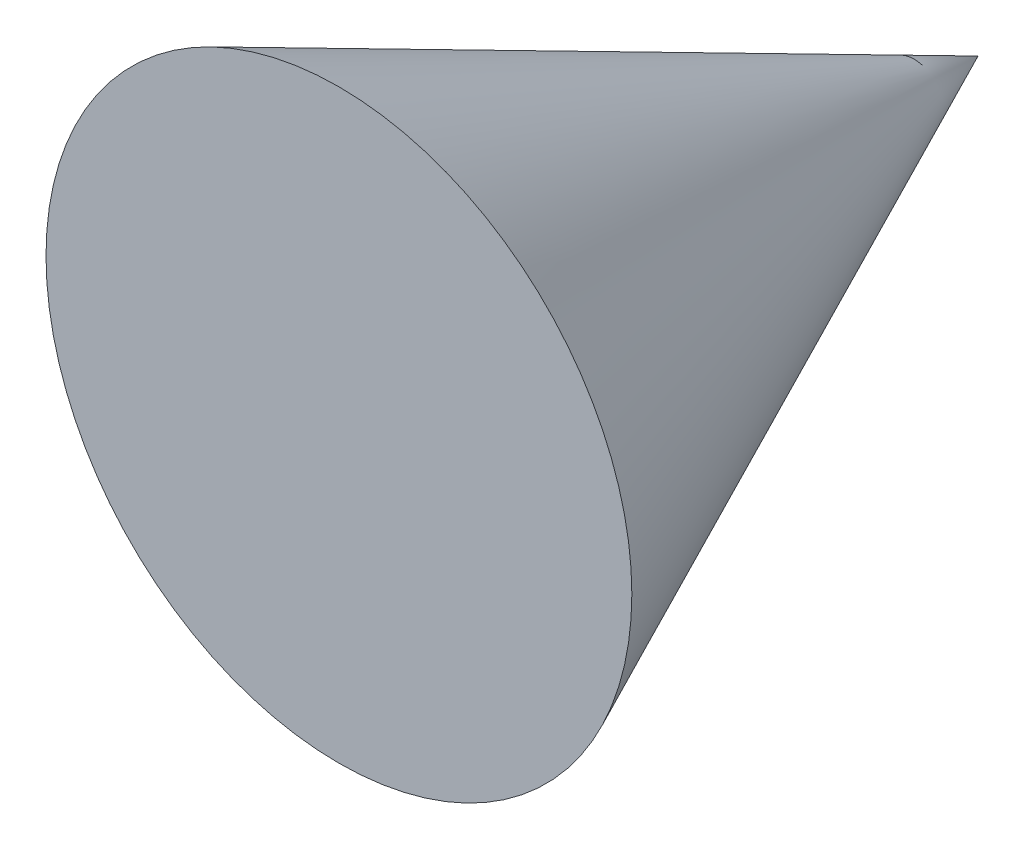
from build123d import *


with BuildPart() as part:
    # Sketch 1 → Revolve 1 (revolve)
    with BuildSketch(Plane(origin=(0, 0, 0), x_dir=(1, 0, 0), z_dir=(0, 1, 0)), mode=Mode.PRIVATE) as revolve_1_sk:
        Polygon((0, 45.413246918), (-25, -9.130313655), (0, -9.130313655), align=None)
    revolve(revolve_1_sk.sketch.rotate(Axis((0, 0, -60.138235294), (0, 0, 1)), 180), axis=Axis((0, 0, -60.138235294), (0, 0, 1)))


solid = part.part
